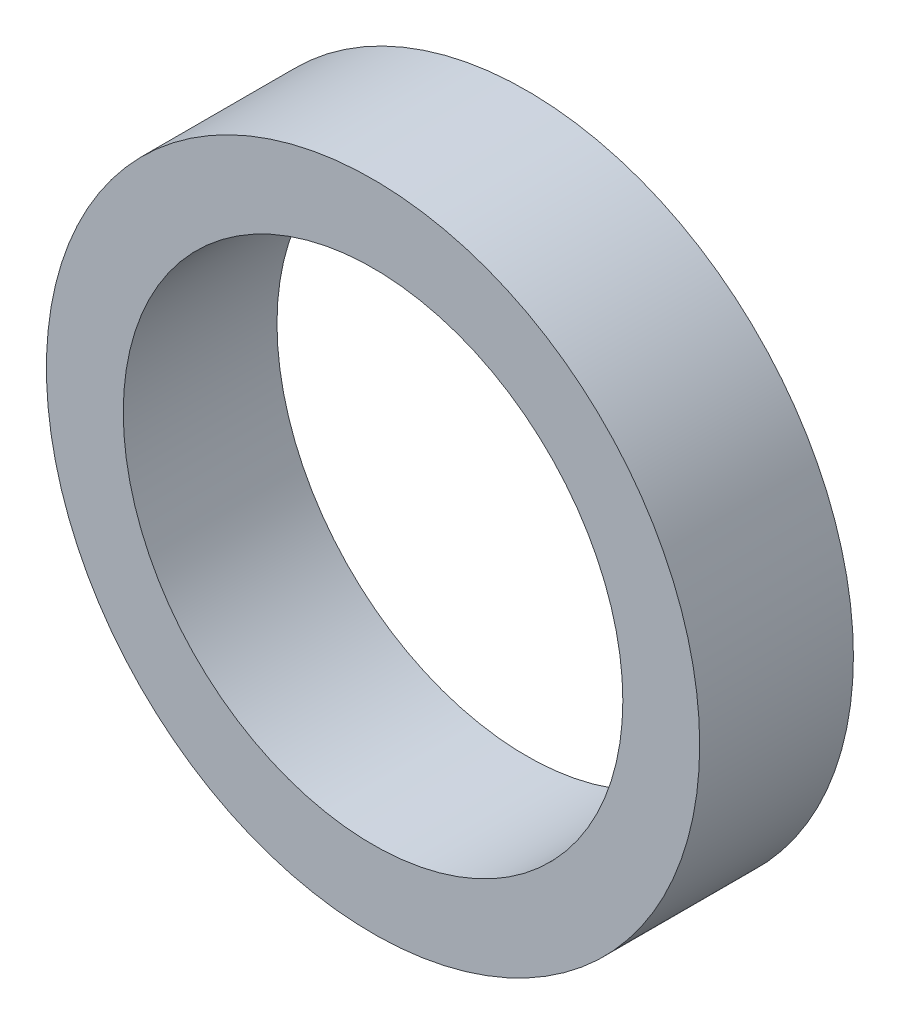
ISO-10303-21;
HEADER;
FILE_DESCRIPTION(('STEP AP214'),'2;1');
FILE_NAME('part.step','',(''),(''),'','','');
FILE_SCHEMA(('AUTOMOTIVE_DESIGN { 1 0 10303 214 1 1 1 1 }'));
ENDSEC;
DATA;
#1=APPLICATION_CONTEXT('core data for automotive mechanical design processes');
#2=APPLICATION_PROTOCOL_DEFINITION('international standard','automotive_design',2000,#1);
#3=PRODUCT_CONTEXT('',#1,'mechanical');
#4=PRODUCT('Part','Part','',(#3));
#5=PRODUCT_RELATED_PRODUCT_CATEGORY('part','',(#4));
#6=PRODUCT_DEFINITION_FORMATION('','',#4);
#7=PRODUCT_DEFINITION_CONTEXT('part definition',#1,'design');
#8=PRODUCT_DEFINITION('design','',#6,#7);
#9=PRODUCT_DEFINITION_SHAPE('','',#8);
#10=(LENGTH_UNIT() NAMED_UNIT(*) SI_UNIT(.MILLI.,.METRE.));
#11=(NAMED_UNIT(*) PLANE_ANGLE_UNIT() SI_UNIT($,.RADIAN.));
#12=(NAMED_UNIT(*) SI_UNIT($,.STERADIAN.) SOLID_ANGLE_UNIT());
#13=UNCERTAINTY_MEASURE_WITH_UNIT(LENGTH_MEASURE(1.E-05),#10,'distance_accuracy_value','');
#14=(GEOMETRIC_REPRESENTATION_CONTEXT(3) GLOBAL_UNCERTAINTY_ASSIGNED_CONTEXT((#13)) GLOBAL_UNIT_ASSIGNED_CONTEXT((#10,
#11,#12)) REPRESENTATION_CONTEXT('',''));
#15=CARTESIAN_POINT('',(0.,0.,0.));
#16=DIRECTION('',(0.,0.,1.));
#17=DIRECTION('',(1.,0.,0.));
#18=AXIS2_PLACEMENT_3D('',#15,#16,#17);
#19=CARTESIAN_POINT('',(0.,0.,12.7));
#20=DIRECTION('',(0.,0.,1.));
#21=DIRECTION('',(1.,0.,0.));
#22=AXIS2_PLACEMENT_3D('',#19,#20,#21);
#23=PLANE('',#22);
#24=CARTESIAN_POINT('',(0.,0.,12.7));
#25=DIRECTION('',(0.,0.,1.));
#26=DIRECTION('',(1.,0.,0.));
#27=AXIS2_PLACEMENT_3D('',#24,#25,#26);
#28=CIRCLE('',#27,26.9875);
#29=CARTESIAN_POINT('',(26.9875,0.,12.7));
#30=VERTEX_POINT('',#29);
#31=EDGE_CURVE('E10',#30,#30,#28,.T.);
#32=ORIENTED_EDGE('',*,*,#31,.T.);
#33=EDGE_LOOP('',(#32));
#34=FACE_BOUND('',#33,.T.);
#35=CARTESIAN_POINT('',(0.,0.,12.7));
#36=DIRECTION('',(0.,0.,1.));
#37=DIRECTION('',(1.,0.,0.));
#38=AXIS2_PLACEMENT_3D('',#35,#36,#37);
#39=CIRCLE('',#38,20.6375);
#40=CARTESIAN_POINT('',(20.6375,0.,12.7));
#41=VERTEX_POINT('',#40);
#42=EDGE_CURVE('E42',#41,#41,#39,.T.);
#43=ORIENTED_EDGE('',*,*,#42,.F.);
#44=EDGE_LOOP('',(#43));
#45=FACE_BOUND('',#44,.T.);
#46=ADVANCED_FACE('F31',(#34,#45),#23,.T.);
#47=CARTESIAN_POINT('',(0.,0.,0.));
#48=DIRECTION('',(0.,0.,1.));
#49=DIRECTION('',(1.,0.,0.));
#50=AXIS2_PLACEMENT_3D('',#47,#48,#49);
#51=PLANE('',#50);
#52=CARTESIAN_POINT('',(0.,0.,0.));
#53=DIRECTION('',(0.,0.,1.));
#54=DIRECTION('',(1.,0.,0.));
#55=AXIS2_PLACEMENT_3D('',#52,#53,#54);
#56=CIRCLE('',#55,26.9875);
#57=CARTESIAN_POINT('',(26.9875,0.,0.));
#58=VERTEX_POINT('',#57);
#59=EDGE_CURVE('E38',#58,#58,#56,.T.);
#60=ORIENTED_EDGE('',*,*,#59,.F.);
#61=EDGE_LOOP('',(#60));
#62=FACE_BOUND('',#61,.T.);
#63=CARTESIAN_POINT('',(0.,0.,0.));
#64=DIRECTION('',(0.,0.,1.));
#65=DIRECTION('',(1.,0.,0.));
#66=AXIS2_PLACEMENT_3D('',#63,#64,#65);
#67=CIRCLE('',#66,20.6375);
#68=CARTESIAN_POINT('',(20.6375,0.,0.));
#69=VERTEX_POINT('',#68);
#70=EDGE_CURVE('E46',#69,#69,#67,.T.);
#71=ORIENTED_EDGE('',*,*,#70,.T.);
#72=EDGE_LOOP('',(#71));
#73=FACE_BOUND('',#72,.T.);
#74=ADVANCED_FACE('F52',(#62,#73),#51,.F.);
#75=CARTESIAN_POINT('',(0.,0.,12.7));
#76=DIRECTION('',(0.,0.,-1.));
#77=DIRECTION('',(-1.,0.,0.));
#78=AXIS2_PLACEMENT_3D('',#75,#76,#77);
#79=CYLINDRICAL_SURFACE('',#78,26.9875);
#80=ORIENTED_EDGE('',*,*,#31,.F.);
#81=EDGE_LOOP('',(#80));
#82=FACE_BOUND('',#81,.T.);
#83=ORIENTED_EDGE('',*,*,#59,.T.);
#84=EDGE_LOOP('',(#83));
#85=FACE_BOUND('',#84,.T.);
#86=ADVANCED_FACE('F33',(#82,#85),#79,.T.);
#87=CARTESIAN_POINT('',(0.,0.,12.7));
#88=DIRECTION('',(0.,0.,-1.));
#89=DIRECTION('',(-1.,0.,0.));
#90=AXIS2_PLACEMENT_3D('',#87,#88,#89);
#91=CYLINDRICAL_SURFACE('',#90,20.6375);
#92=ORIENTED_EDGE('',*,*,#42,.T.);
#93=EDGE_LOOP('',(#92));
#94=FACE_BOUND('',#93,.T.);
#95=ORIENTED_EDGE('',*,*,#70,.F.);
#96=EDGE_LOOP('',(#95));
#97=FACE_BOUND('',#96,.T.);
#98=ADVANCED_FACE('F54',(#94,#97),#91,.F.);
#99=CLOSED_SHELL('',(#46,#74,#86,#98));
#100=MANIFOLD_SOLID_BREP('B2',#99);
#101=ADVANCED_BREP_SHAPE_REPRESENTATION('',(#18,#100),#14);
#102=SHAPE_DEFINITION_REPRESENTATION(#9,#101);
ENDSEC;
END-ISO-10303-21;
